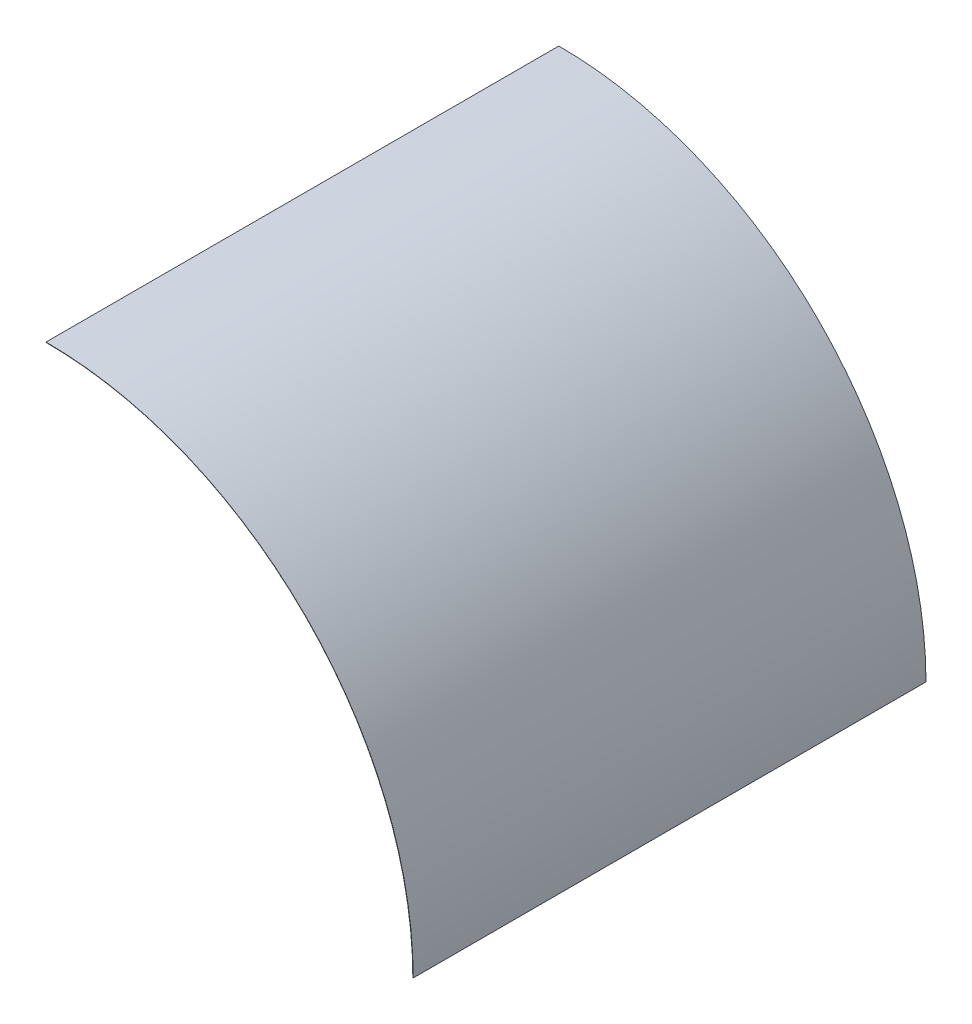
from build123d import *

# Parameters (mm, degrees)
BOSS_EXTRUDE1_DEPTH = 3000


with BuildPart() as part:
    # Sketch1 → Boss-Extrude1 (new body)
    with BuildSketch(Plane.XY):
        with BuildLine():
            Line((0, 2148), (0, 2146))
            ThreePointArc((0, 2146), (1517.451152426, 1517.451152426), (2146, 0))
            Line((2146, 0), (2148, 0))
            ThreePointArc((2148, 0), (1518.865365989, 1518.865365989), (0, 2148))
        make_face()
    extrude(amount=-BOSS_EXTRUDE1_DEPTH)


solid = part.part
